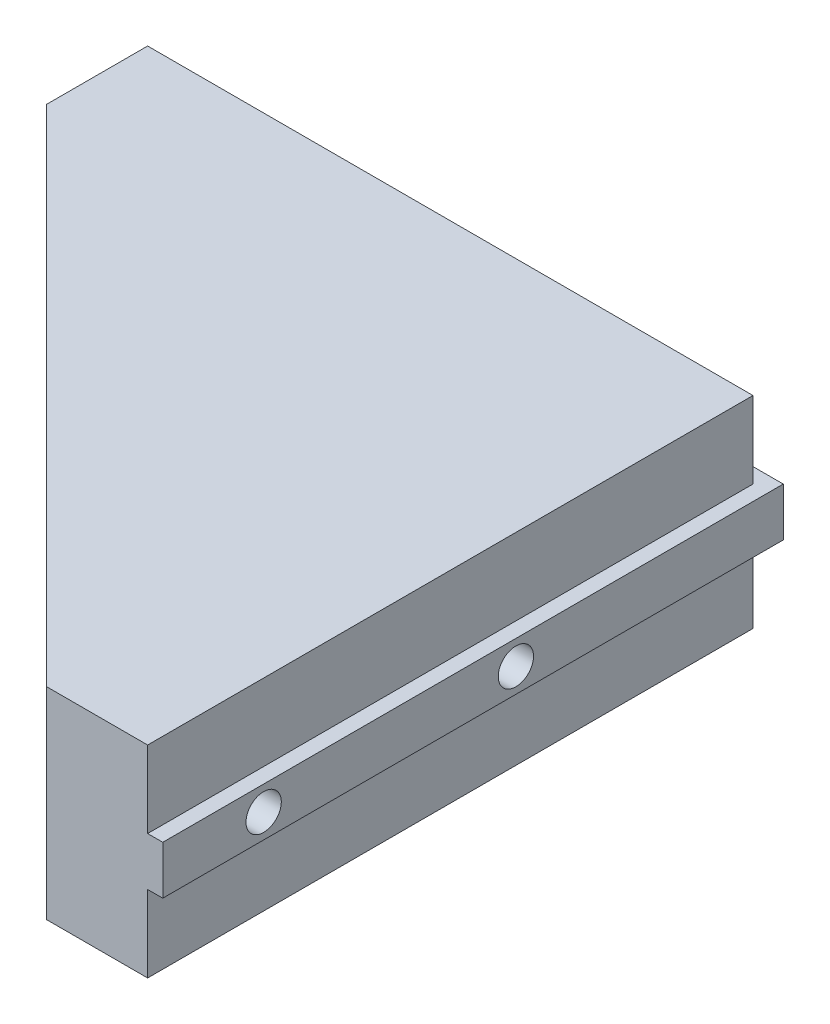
ISO-10303-21;
HEADER;
FILE_DESCRIPTION(('STEP AP214'),'2;1');
FILE_NAME('part.step','',(''),(''),'','','');
FILE_SCHEMA(('AUTOMOTIVE_DESIGN { 1 0 10303 214 1 1 1 1 }'));
ENDSEC;
DATA;
#1=APPLICATION_CONTEXT('core data for automotive mechanical design processes');
#2=APPLICATION_PROTOCOL_DEFINITION('international standard','automotive_design',2000,#1);
#3=PRODUCT_CONTEXT('',#1,'mechanical');
#4=PRODUCT('Part','Part','',(#3));
#5=PRODUCT_RELATED_PRODUCT_CATEGORY('part','',(#4));
#6=PRODUCT_DEFINITION_FORMATION('','',#4);
#7=PRODUCT_DEFINITION_CONTEXT('part definition',#1,'design');
#8=PRODUCT_DEFINITION('design','',#6,#7);
#9=PRODUCT_DEFINITION_SHAPE('','',#8);
#10=(LENGTH_UNIT() NAMED_UNIT(*) SI_UNIT(.MILLI.,.METRE.));
#11=(NAMED_UNIT(*) PLANE_ANGLE_UNIT() SI_UNIT($,.RADIAN.));
#12=(NAMED_UNIT(*) SI_UNIT($,.STERADIAN.) SOLID_ANGLE_UNIT());
#13=UNCERTAINTY_MEASURE_WITH_UNIT(LENGTH_MEASURE(1.E-05),#10,'distance_accuracy_value','');
#14=(GEOMETRIC_REPRESENTATION_CONTEXT(3) GLOBAL_UNCERTAINTY_ASSIGNED_CONTEXT((#13)) GLOBAL_UNIT_ASSIGNED_CONTEXT((#10,
#11,#12)) REPRESENTATION_CONTEXT('',''));
#15=CARTESIAN_POINT('',(0.,0.,0.));
#16=DIRECTION('',(0.,0.,1.));
#17=DIRECTION('',(1.,0.,0.));
#18=AXIS2_PLACEMENT_3D('',#15,#16,#17);
#19=CARTESIAN_POINT('',(0.,10.,0.));
#20=DIRECTION('',(-1.,0.,0.));
#21=DIRECTION('',(0.,0.,1.));
#22=AXIS2_PLACEMENT_3D('',#19,#20,#21);
#23=PLANE('',#22);
#24=DIRECTION('',(0.,0.,1.));
#25=VECTOR('',#24,1.);
#26=CARTESIAN_POINT('',(0.,-2.4,60.));
#27=LINE('',#26,#25);
#28=CARTESIAN_POINT('',(0.,-2.4,0.));
#29=VERTEX_POINT('',#28);
#30=CARTESIAN_POINT('',(0.,-2.4,60.));
#31=VERTEX_POINT('',#30);
#32=EDGE_CURVE('E63',#29,#31,#27,.T.);
#33=ORIENTED_EDGE('',*,*,#32,.T.);
#34=DIRECTION('',(0.,-1.,0.));
#35=VECTOR('',#34,1.);
#36=CARTESIAN_POINT('',(0.,10.,60.));
#37=LINE('',#36,#35);
#38=CARTESIAN_POINT('',(0.,-10.,60.));
#39=VERTEX_POINT('',#38);
#40=EDGE_CURVE('E362',#31,#39,#37,.T.);
#41=ORIENTED_EDGE('',*,*,#40,.T.);
#42=DIRECTION('',(0.,0.,-1.));
#43=VECTOR('',#42,1.);
#44=CARTESIAN_POINT('',(0.,-10.,0.));
#45=LINE('',#44,#43);
#46=CARTESIAN_POINT('',(0.,-10.,0.));
#47=VERTEX_POINT('',#46);
#48=EDGE_CURVE('E346',#39,#47,#45,.T.);
#49=ORIENTED_EDGE('',*,*,#48,.T.);
#50=DIRECTION('',(0.,-1.,0.));
#51=VECTOR('',#50,1.);
#52=CARTESIAN_POINT('',(0.,10.,0.));
#53=LINE('',#52,#51);
#54=EDGE_CURVE('E357',#29,#47,#53,.T.);
#55=ORIENTED_EDGE('',*,*,#54,.F.);
#56=EDGE_LOOP('',(#33,#41,#49,#55));
#57=FACE_BOUND('',#56,.T.);
#58=ADVANCED_FACE('F45',(#57),#23,.F.);
#59=CARTESIAN_POINT('',(-60.,10.,0.));
#60=DIRECTION('',(0.,0.,1.));
#61=DIRECTION('',(1.,0.,0.));
#62=AXIS2_PLACEMENT_3D('',#59,#60,#61);
#63=PLANE('',#62);
#64=DIRECTION('',(1.,0.,0.));
#65=VECTOR('',#64,1.);
#66=CARTESIAN_POINT('',(0.,-2.4,0.));
#67=LINE('',#66,#65);
#68=CARTESIAN_POINT('',(-60.,-2.4,0.));
#69=VERTEX_POINT('',#68);
#70=EDGE_CURVE('E269',#69,#29,#67,.T.);
#71=ORIENTED_EDGE('',*,*,#70,.T.);
#72=ORIENTED_EDGE('',*,*,#54,.T.);
#73=DIRECTION('',(-1.,0.,0.));
#74=VECTOR('',#73,1.);
#75=CARTESIAN_POINT('',(-60.,-10.,0.));
#76=LINE('',#75,#74);
#77=CARTESIAN_POINT('',(-60.,-10.,0.));
#78=VERTEX_POINT('',#77);
#79=EDGE_CURVE('E319',#47,#78,#76,.T.);
#80=ORIENTED_EDGE('',*,*,#79,.T.);
#81=DIRECTION('',(0.,-1.,0.));
#82=VECTOR('',#81,1.);
#83=CARTESIAN_POINT('',(-60.,10.,0.));
#84=LINE('',#83,#82);
#85=EDGE_CURVE('E328',#69,#78,#84,.T.);
#86=ORIENTED_EDGE('',*,*,#85,.F.);
#87=EDGE_LOOP('',(#71,#72,#80,#86));
#88=FACE_BOUND('',#87,.T.);
#89=ADVANCED_FACE('F527',(#88),#63,.F.);
#90=CARTESIAN_POINT('',(-60.,10.,10.));
#91=DIRECTION('',(1.,0.,0.));
#92=DIRECTION('',(0.,0.,-1.));
#93=AXIS2_PLACEMENT_3D('',#90,#91,#92);
#94=PLANE('',#93);
#95=DIRECTION('',(0.,0.,1.));
#96=VECTOR('',#95,1.);
#97=CARTESIAN_POINT('',(-60.,-10.,10.));
#98=LINE('',#97,#96);
#99=CARTESIAN_POINT('',(-60.,-10.,10.));
#100=VERTEX_POINT('',#99);
#101=EDGE_CURVE('E188',#78,#100,#98,.T.);
#102=ORIENTED_EDGE('',*,*,#101,.T.);
#103=DIRECTION('',(0.,-1.,0.));
#104=VECTOR('',#103,1.);
#105=CARTESIAN_POINT('',(-60.,10.,10.));
#106=LINE('',#105,#104);
#107=CARTESIAN_POINT('',(-60.,4.,10.));
#108=VERTEX_POINT('',#107);
#109=EDGE_CURVE('E55',#108,#100,#106,.T.);
#110=ORIENTED_EDGE('',*,*,#109,.F.);
#111=CARTESIAN_POINT('',(-60.,10.,10.));
#112=VERTEX_POINT('',#111);
#113=EDGE_CURVE('E11',#112,#108,#106,.T.);
#114=ORIENTED_EDGE('',*,*,#113,.F.);
#115=DIRECTION('',(0.,0.,1.));
#116=VECTOR('',#115,1.);
#117=CARTESIAN_POINT('',(-60.,10.,10.));
#118=LINE('',#117,#116);
#119=CARTESIAN_POINT('',(-60.,10.,0.));
#120=VERTEX_POINT('',#119);
#121=EDGE_CURVE('E315',#120,#112,#118,.T.);
#122=ORIENTED_EDGE('',*,*,#121,.F.);
#123=CARTESIAN_POINT('',(-60.,2.4,0.));
#124=VERTEX_POINT('',#123);
#125=EDGE_CURVE('E353',#120,#124,#84,.T.);
#126=ORIENTED_EDGE('',*,*,#125,.T.);
#127=DIRECTION('',(0.,0.,1.));
#128=VECTOR('',#127,1.);
#129=CARTESIAN_POINT('',(-60.,2.4,0.));
#130=LINE('',#129,#128);
#131=CARTESIAN_POINT('',(-60.,2.4,-1.5));
#132=VERTEX_POINT('',#131);
#133=EDGE_CURVE('E278',#132,#124,#130,.T.);
#134=ORIENTED_EDGE('',*,*,#133,.F.);
#135=DIRECTION('',(0.,-1.,0.));
#136=VECTOR('',#135,1.);
#137=CARTESIAN_POINT('',(-60.,2.4,-1.5));
#138=LINE('',#137,#136);
#139=CARTESIAN_POINT('',(-60.,-2.4,-1.5));
#140=VERTEX_POINT('',#139);
#141=EDGE_CURVE('E286',#132,#140,#138,.T.);
#142=ORIENTED_EDGE('',*,*,#141,.T.);
#143=DIRECTION('',(0.,0.,1.));
#144=VECTOR('',#143,1.);
#145=CARTESIAN_POINT('',(-60.,-2.4,0.));
#146=LINE('',#145,#144);
#147=EDGE_CURVE('E298',#140,#69,#146,.T.);
#148=ORIENTED_EDGE('',*,*,#147,.T.);
#149=ORIENTED_EDGE('',*,*,#85,.T.);
#150=EDGE_LOOP('',(#102,#110,#114,#122,#126,#134,#142,#148,#149));
#151=FACE_BOUND('',#150,.T.);
#152=ADVANCED_FACE('F47',(#151),#94,.F.);
#153=CARTESIAN_POINT('',(-60.,10.,10.));
#154=DIRECTION('',(0.,0.,-1.));
#155=DIRECTION('',(-1.,0.,0.));
#156=AXIS2_PLACEMENT_3D('',#153,#154,#155);
#157=PLANE('',#156);
#158=CARTESIAN_POINT('',(-25.,0.,10.));
#159=DIRECTION('',(0.,0.,-1.));
#160=DIRECTION('',(-1.,0.,0.));
#161=AXIS2_PLACEMENT_3D('',#158,#159,#160);
#162=CIRCLE('',#161,3.5);
#163=CARTESIAN_POINT('',(-28.5,0.,10.));
#164=VERTEX_POINT('',#163);
#165=EDGE_CURVE('E49',#164,#164,#162,.T.);
#166=ORIENTED_EDGE('',*,*,#165,.T.);
#167=EDGE_LOOP('',(#166));
#168=FACE_BOUND('',#167,.T.);
#169=CARTESIAN_POINT('',(-50.,0.,10.));
#170=DIRECTION('',(0.,0.,-1.));
#171=DIRECTION('',(-1.,0.,0.));
#172=AXIS2_PLACEMENT_3D('',#169,#170,#171);
#173=CIRCLE('',#172,3.5);
#174=CARTESIAN_POINT('',(-53.5,0.,10.));
#175=VERTEX_POINT('',#174);
#176=EDGE_CURVE('E223',#175,#175,#173,.T.);
#177=ORIENTED_EDGE('',*,*,#176,.T.);
#178=EDGE_LOOP('',(#177));
#179=FACE_BOUND('',#178,.T.);
#180=DIRECTION('',(0.,-1.,0.));
#181=VECTOR('',#180,1.);
#182=CARTESIAN_POINT('',(-20.,10.,10.));
#183=LINE('',#182,#181);
#184=CARTESIAN_POINT('',(-20.,4.,10.));
#185=VERTEX_POINT('',#184);
#186=CARTESIAN_POINT('',(-20.,-10.,10.));
#187=VERTEX_POINT('',#186);
#188=EDGE_CURVE('E183',#185,#187,#183,.T.);
#189=ORIENTED_EDGE('',*,*,#188,.F.);
#190=DIRECTION('',(-1.,0.,0.));
#191=VECTOR('',#190,1.);
#192=CARTESIAN_POINT('',(-20.,4.,10.));
#193=LINE('',#192,#191);
#194=EDGE_CURVE('E172',#185,#108,#193,.T.);
#195=ORIENTED_EDGE('',*,*,#194,.T.);
#196=ORIENTED_EDGE('',*,*,#109,.T.);
#197=DIRECTION('',(1.,0.,0.));
#198=VECTOR('',#197,1.);
#199=CARTESIAN_POINT('',(-60.,-10.,10.));
#200=LINE('',#199,#198);
#201=EDGE_CURVE('E331',#100,#187,#200,.T.);
#202=ORIENTED_EDGE('',*,*,#201,.T.);
#203=EDGE_LOOP('',(#189,#195,#196,#202));
#204=FACE_BOUND('',#203,.T.);
#205=ADVANCED_FACE('F180',(#168,#179,#204),#157,.F.);
#206=CARTESIAN_POINT('',(-20.,10.,10.));
#207=DIRECTION('',(0.707106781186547,0.,-0.707106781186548));
#208=DIRECTION('',(-0.707106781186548,0.,-0.707106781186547));
#209=AXIS2_PLACEMENT_3D('',#206,#207,#208);
#210=PLANE('',#209);
#211=DIRECTION('',(0.,-1.,0.));
#212=VECTOR('',#211,1.);
#213=CARTESIAN_POINT('',(-9.99999999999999,10.,20.));
#214=LINE('',#213,#212);
#215=CARTESIAN_POINT('',(-9.99999999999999,4.,20.));
#216=VERTEX_POINT('',#215);
#217=CARTESIAN_POINT('',(-9.99999999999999,-10.,20.));
#218=VERTEX_POINT('',#217);
#219=EDGE_CURVE('E193',#216,#218,#214,.T.);
#220=ORIENTED_EDGE('',*,*,#219,.F.);
#221=DIRECTION('',(-0.707106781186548,0.,-0.707106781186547));
#222=VECTOR('',#221,1.);
#223=CARTESIAN_POINT('',(-9.99999999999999,4.,20.));
#224=LINE('',#223,#222);
#225=EDGE_CURVE('E470',#216,#185,#224,.T.);
#226=ORIENTED_EDGE('',*,*,#225,.T.);
#227=ORIENTED_EDGE('',*,*,#188,.T.);
#228=DIRECTION('',(0.707106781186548,0.,0.707106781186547));
#229=VECTOR('',#228,1.);
#230=CARTESIAN_POINT('',(-20.,-10.,10.));
#231=LINE('',#230,#229);
#232=EDGE_CURVE('E334',#187,#218,#231,.T.);
#233=ORIENTED_EDGE('',*,*,#232,.T.);
#234=EDGE_LOOP('',(#220,#226,#227,#233));
#235=FACE_BOUND('',#234,.T.);
#236=ADVANCED_FACE('F378',(#235),#210,.F.);
#237=CARTESIAN_POINT('',(-9.99999999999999,10.,20.));
#238=DIRECTION('',(1.,0.,0.));
#239=DIRECTION('',(0.,0.,-1.));
#240=AXIS2_PLACEMENT_3D('',#237,#238,#239);
#241=PLANE('',#240);
#242=CARTESIAN_POINT('',(-9.99999999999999,0.,50.));
#243=DIRECTION('',(1.,0.,0.));
#244=DIRECTION('',(0.,0.,-1.));
#245=AXIS2_PLACEMENT_3D('',#242,#243,#244);
#246=CIRCLE('',#245,3.5);
#247=CARTESIAN_POINT('',(-9.99999999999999,0.,46.5));
#248=VERTEX_POINT('',#247);
#249=EDGE_CURVE('E210',#248,#248,#246,.T.);
#250=ORIENTED_EDGE('',*,*,#249,.T.);
#251=EDGE_LOOP('',(#250));
#252=FACE_BOUND('',#251,.T.);
#253=CARTESIAN_POINT('',(-9.99999999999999,0.,25.));
#254=DIRECTION('',(1.,0.,0.));
#255=DIRECTION('',(0.,0.,-1.));
#256=AXIS2_PLACEMENT_3D('',#253,#254,#255);
#257=CIRCLE('',#256,3.5);
#258=CARTESIAN_POINT('',(-9.99999999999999,0.,21.5));
#259=VERTEX_POINT('',#258);
#260=EDGE_CURVE('E206',#259,#259,#257,.T.);
#261=ORIENTED_EDGE('',*,*,#260,.T.);
#262=EDGE_LOOP('',(#261));
#263=FACE_BOUND('',#262,.T.);
#264=DIRECTION('',(0.,-1.,0.));
#265=VECTOR('',#264,1.);
#266=CARTESIAN_POINT('',(-9.99999999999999,10.,60.));
#267=LINE('',#266,#265);
#268=CARTESIAN_POINT('',(-9.99999999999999,4.,60.));
#269=VERTEX_POINT('',#268);
#270=CARTESIAN_POINT('',(-9.99999999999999,-10.,60.));
#271=VERTEX_POINT('',#270);
#272=EDGE_CURVE('E365',#269,#271,#267,.T.);
#273=ORIENTED_EDGE('',*,*,#272,.F.);
#274=DIRECTION('',(0.,0.,-1.));
#275=VECTOR('',#274,1.);
#276=CARTESIAN_POINT('',(-9.99999999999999,4.,60.));
#277=LINE('',#276,#275);
#278=EDGE_CURVE('E175',#269,#216,#277,.T.);
#279=ORIENTED_EDGE('',*,*,#278,.T.);
#280=ORIENTED_EDGE('',*,*,#219,.T.);
#281=DIRECTION('',(0.,0.,1.));
#282=VECTOR('',#281,1.);
#283=CARTESIAN_POINT('',(-9.99999999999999,-10.,20.));
#284=LINE('',#283,#282);
#285=EDGE_CURVE('E338',#218,#271,#284,.T.);
#286=ORIENTED_EDGE('',*,*,#285,.T.);
#287=EDGE_LOOP('',(#273,#279,#280,#286));
#288=FACE_BOUND('',#287,.T.);
#289=ADVANCED_FACE('F373',(#252,#263,#288),#241,.F.);
#290=CARTESIAN_POINT('',(0.,10.,60.));
#291=DIRECTION('',(0.,0.,-1.));
#292=DIRECTION('',(-1.,0.,0.));
#293=AXIS2_PLACEMENT_3D('',#290,#291,#292);
#294=PLANE('',#293);
#295=DIRECTION('',(1.,0.,0.));
#296=VECTOR('',#295,1.);
#297=CARTESIAN_POINT('',(0.,-10.,60.));
#298=LINE('',#297,#296);
#299=EDGE_CURVE('E342',#271,#39,#298,.T.);
#300=ORIENTED_EDGE('',*,*,#299,.T.);
#301=ORIENTED_EDGE('',*,*,#40,.F.);
#302=DIRECTION('',(1.,0.,0.));
#303=VECTOR('',#302,1.);
#304=CARTESIAN_POINT('',(1.50000000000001,-2.4,60.));
#305=LINE('',#304,#303);
#306=CARTESIAN_POINT('',(1.50000000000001,-2.4,60.));
#307=VERTEX_POINT('',#306);
#308=EDGE_CURVE('E289',#31,#307,#305,.T.);
#309=ORIENTED_EDGE('',*,*,#308,.T.);
#310=DIRECTION('',(0.,-1.,0.));
#311=VECTOR('',#310,1.);
#312=CARTESIAN_POINT('',(1.50000000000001,2.4,60.));
#313=LINE('',#312,#311);
#314=CARTESIAN_POINT('',(1.50000000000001,2.4,60.));
#315=VERTEX_POINT('',#314);
#316=EDGE_CURVE('E311',#315,#307,#313,.T.);
#317=ORIENTED_EDGE('',*,*,#316,.F.);
#318=DIRECTION('',(1.,0.,0.));
#319=VECTOR('',#318,1.);
#320=CARTESIAN_POINT('',(1.50000000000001,2.4,60.));
#321=LINE('',#320,#319);
#322=CARTESIAN_POINT('',(0.,2.4,60.));
#323=VERTEX_POINT('',#322);
#324=EDGE_CURVE('E268',#323,#315,#321,.T.);
#325=ORIENTED_EDGE('',*,*,#324,.F.);
#326=CARTESIAN_POINT('',(0.,10.,60.));
#327=VERTEX_POINT('',#326);
#328=EDGE_CURVE('E71',#327,#323,#37,.T.);
#329=ORIENTED_EDGE('',*,*,#328,.F.);
#330=DIRECTION('',(1.,0.,0.));
#331=VECTOR('',#330,1.);
#332=CARTESIAN_POINT('',(0.,10.,60.));
#333=LINE('',#332,#331);
#334=CARTESIAN_POINT('',(-9.99999999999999,10.,60.));
#335=VERTEX_POINT('',#334);
#336=EDGE_CURVE('E318',#335,#327,#333,.T.);
#337=ORIENTED_EDGE('',*,*,#336,.F.);
#338=EDGE_CURVE('E366',#335,#269,#267,.T.);
#339=ORIENTED_EDGE('',*,*,#338,.T.);
#340=ORIENTED_EDGE('',*,*,#272,.T.);
#341=EDGE_LOOP('',(#300,#301,#309,#317,#325,#329,#337,#339,#340));
#342=FACE_BOUND('',#341,.T.);
#343=ADVANCED_FACE('F384',(#342),#294,.F.);
#344=ORIENTED_EDGE('',*,*,#328,.T.);
#345=DIRECTION('',(0.,0.,1.));
#346=VECTOR('',#345,1.);
#347=CARTESIAN_POINT('',(0.,2.4,60.));
#348=LINE('',#347,#346);
#349=CARTESIAN_POINT('',(0.,2.4,0.));
#350=VERTEX_POINT('',#349);
#351=EDGE_CURVE('E264',#350,#323,#348,.T.);
#352=ORIENTED_EDGE('',*,*,#351,.F.);
#353=CARTESIAN_POINT('',(0.,10.,0.));
#354=VERTEX_POINT('',#353);
#355=EDGE_CURVE('E358',#354,#350,#53,.T.);
#356=ORIENTED_EDGE('',*,*,#355,.F.);
#357=DIRECTION('',(0.,0.,-1.));
#358=VECTOR('',#357,1.);
#359=CARTESIAN_POINT('',(0.,10.,0.));
#360=LINE('',#359,#358);
#361=EDGE_CURVE('E322',#327,#354,#360,.T.);
#362=ORIENTED_EDGE('',*,*,#361,.F.);
#363=EDGE_LOOP('',(#344,#352,#356,#362));
#364=FACE_BOUND('',#363,.T.);
#365=ADVANCED_FACE('F530',(#364),#23,.F.);
#366=ORIENTED_EDGE('',*,*,#355,.T.);
#367=DIRECTION('',(1.,0.,0.));
#368=VECTOR('',#367,1.);
#369=CARTESIAN_POINT('',(0.,2.4,0.));
#370=LINE('',#369,#368);
#371=EDGE_CURVE('E282',#124,#350,#370,.T.);
#372=ORIENTED_EDGE('',*,*,#371,.F.);
#373=ORIENTED_EDGE('',*,*,#125,.F.);
#374=DIRECTION('',(-1.,0.,0.));
#375=VECTOR('',#374,1.);
#376=CARTESIAN_POINT('',(-60.,10.,0.));
#377=LINE('',#376,#375);
#378=EDGE_CURVE('E325',#354,#120,#377,.T.);
#379=ORIENTED_EDGE('',*,*,#378,.F.);
#380=EDGE_LOOP('',(#366,#372,#373,#379));
#381=FACE_BOUND('',#380,.T.);
#382=ADVANCED_FACE('F535',(#381),#63,.F.);
#383=CARTESIAN_POINT('',(0.,10.,0.));
#384=DIRECTION('',(0.,-1.,0.));
#385=DIRECTION('',(0.,0.,-1.));
#386=AXIS2_PLACEMENT_3D('',#383,#384,#385);
#387=PLANE('',#386);
#388=ORIENTED_EDGE('',*,*,#121,.T.);
#389=DIRECTION('',(0.707106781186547,0.,0.707106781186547));
#390=VECTOR('',#389,1.);
#391=CARTESIAN_POINT('',(-60.,10.,10.));
#392=LINE('',#391,#390);
#393=EDGE_CURVE('E164',#112,#335,#392,.T.);
#394=ORIENTED_EDGE('',*,*,#393,.T.);
#395=ORIENTED_EDGE('',*,*,#336,.T.);
#396=ORIENTED_EDGE('',*,*,#361,.T.);
#397=ORIENTED_EDGE('',*,*,#378,.T.);
#398=EDGE_LOOP('',(#388,#394,#395,#396,#397));
#399=FACE_BOUND('',#398,.T.);
#400=ADVANCED_FACE('F542',(#399),#387,.F.);
#401=CARTESIAN_POINT('',(0.,-10.,0.));
#402=DIRECTION('',(0.,-1.,0.));
#403=DIRECTION('',(0.,0.,-1.));
#404=AXIS2_PLACEMENT_3D('',#401,#402,#403);
#405=PLANE('',#404);
#406=ORIENTED_EDGE('',*,*,#101,.F.);
#407=ORIENTED_EDGE('',*,*,#79,.F.);
#408=ORIENTED_EDGE('',*,*,#48,.F.);
#409=ORIENTED_EDGE('',*,*,#299,.F.);
#410=ORIENTED_EDGE('',*,*,#285,.F.);
#411=ORIENTED_EDGE('',*,*,#232,.F.);
#412=ORIENTED_EDGE('',*,*,#201,.F.);
#413=EDGE_LOOP('',(#406,#407,#408,#409,#410,#411,#412));
#414=FACE_BOUND('',#413,.T.);
#415=ADVANCED_FACE('F380',(#414),#405,.T.);
#416=CARTESIAN_POINT('',(1.5,2.4,-1.5));
#417=DIRECTION('',(-1.,0.,0.));
#418=DIRECTION('',(0.,0.,1.));
#419=AXIS2_PLACEMENT_3D('',#416,#417,#418);
#420=PLANE('',#419);
#421=CARTESIAN_POINT('',(1.50000000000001,0.,50.));
#422=DIRECTION('',(1.,0.,0.));
#423=DIRECTION('',(0.,0.,-1.));
#424=AXIS2_PLACEMENT_3D('',#421,#422,#423);
#425=CIRCLE('',#424,1.75);
#426=CARTESIAN_POINT('',(1.50000000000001,0.,48.25));
#427=VERTEX_POINT('',#426);
#428=EDGE_CURVE('E256',#427,#427,#425,.T.);
#429=ORIENTED_EDGE('',*,*,#428,.F.);
#430=EDGE_LOOP('',(#429));
#431=FACE_BOUND('',#430,.T.);
#432=CARTESIAN_POINT('',(1.5,0.,25.));
#433=DIRECTION('',(1.,0.,0.));
#434=DIRECTION('',(0.,0.,-1.));
#435=AXIS2_PLACEMENT_3D('',#432,#433,#434);
#436=CIRCLE('',#435,1.75);
#437=CARTESIAN_POINT('',(1.5,0.,23.25));
#438=VERTEX_POINT('',#437);
#439=EDGE_CURVE('E260',#438,#438,#436,.T.);
#440=ORIENTED_EDGE('',*,*,#439,.F.);
#441=EDGE_LOOP('',(#440));
#442=FACE_BOUND('',#441,.T.);
#443=DIRECTION('',(0.,0.,-1.));
#444=VECTOR('',#443,1.);
#445=CARTESIAN_POINT('',(1.5,-2.4,-1.5));
#446=LINE('',#445,#444);
#447=CARTESIAN_POINT('',(1.5,-2.4,-1.5));
#448=VERTEX_POINT('',#447);
#449=EDGE_CURVE('E292',#307,#448,#446,.T.);
#450=ORIENTED_EDGE('',*,*,#449,.T.);
#451=DIRECTION('',(0.,-1.,0.));
#452=VECTOR('',#451,1.);
#453=CARTESIAN_POINT('',(1.5,2.4,-1.5));
#454=LINE('',#453,#452);
#455=CARTESIAN_POINT('',(1.5,2.4,-1.5));
#456=VERTEX_POINT('',#455);
#457=EDGE_CURVE('E307',#456,#448,#454,.T.);
#458=ORIENTED_EDGE('',*,*,#457,.F.);
#459=DIRECTION('',(0.,0.,-1.));
#460=VECTOR('',#459,1.);
#461=CARTESIAN_POINT('',(1.5,2.4,-1.5));
#462=LINE('',#461,#460);
#463=EDGE_CURVE('E272',#315,#456,#462,.T.);
#464=ORIENTED_EDGE('',*,*,#463,.F.);
#465=ORIENTED_EDGE('',*,*,#316,.T.);
#466=EDGE_LOOP('',(#450,#458,#464,#465));
#467=FACE_BOUND('',#466,.T.);
#468=ADVANCED_FACE('F513',(#431,#442,#467),#420,.F.);
#469=CARTESIAN_POINT('',(-60.,2.4,-1.5));
#470=DIRECTION('',(0.,0.,1.));
#471=DIRECTION('',(1.,0.,0.));
#472=AXIS2_PLACEMENT_3D('',#469,#470,#471);
#473=PLANE('',#472);
#474=CARTESIAN_POINT('',(-50.,0.,-1.5));
#475=DIRECTION('',(0.,0.,-1.));
#476=DIRECTION('',(-1.,0.,0.));
#477=AXIS2_PLACEMENT_3D('',#474,#475,#476);
#478=CIRCLE('',#477,1.74999999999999);
#479=CARTESIAN_POINT('',(-51.75,0.,-1.5));
#480=VERTEX_POINT('',#479);
#481=EDGE_CURVE('E214',#480,#480,#478,.T.);
#482=ORIENTED_EDGE('',*,*,#481,.F.);
#483=EDGE_LOOP('',(#482));
#484=FACE_BOUND('',#483,.T.);
#485=CARTESIAN_POINT('',(-25.,0.,-1.5));
#486=DIRECTION('',(0.,0.,-1.));
#487=DIRECTION('',(-1.,0.,0.));
#488=AXIS2_PLACEMENT_3D('',#485,#486,#487);
#489=CIRCLE('',#488,1.74999999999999);
#490=CARTESIAN_POINT('',(-26.75,0.,-1.5));
#491=VERTEX_POINT('',#490);
#492=EDGE_CURVE('E252',#491,#491,#489,.T.);
#493=ORIENTED_EDGE('',*,*,#492,.F.);
#494=EDGE_LOOP('',(#493));
#495=FACE_BOUND('',#494,.T.);
#496=DIRECTION('',(-1.,0.,0.));
#497=VECTOR('',#496,1.);
#498=CARTESIAN_POINT('',(-60.,-2.4,-1.5));
#499=LINE('',#498,#497);
#500=EDGE_CURVE('E295',#448,#140,#499,.T.);
#501=ORIENTED_EDGE('',*,*,#500,.T.);
#502=ORIENTED_EDGE('',*,*,#141,.F.);
#503=DIRECTION('',(-1.,0.,0.));
#504=VECTOR('',#503,1.);
#505=CARTESIAN_POINT('',(-60.,2.4,-1.5));
#506=LINE('',#505,#504);
#507=EDGE_CURVE('E275',#456,#132,#506,.T.);
#508=ORIENTED_EDGE('',*,*,#507,.F.);
#509=ORIENTED_EDGE('',*,*,#457,.T.);
#510=EDGE_LOOP('',(#501,#502,#508,#509));
#511=FACE_BOUND('',#510,.T.);
#512=ADVANCED_FACE('F509',(#484,#495,#511),#473,.F.);
#513=CARTESIAN_POINT('',(0.,2.4,0.));
#514=DIRECTION('',(0.,1.,0.));
#515=DIRECTION('',(0.,0.,1.));
#516=AXIS2_PLACEMENT_3D('',#513,#514,#515);
#517=PLANE('',#516);
#518=ORIENTED_EDGE('',*,*,#351,.T.);
#519=ORIENTED_EDGE('',*,*,#324,.T.);
#520=ORIENTED_EDGE('',*,*,#463,.T.);
#521=ORIENTED_EDGE('',*,*,#507,.T.);
#522=ORIENTED_EDGE('',*,*,#133,.T.);
#523=ORIENTED_EDGE('',*,*,#371,.T.);
#524=EDGE_LOOP('',(#518,#519,#520,#521,#522,#523));
#525=FACE_BOUND('',#524,.T.);
#526=ADVANCED_FACE('F512',(#525),#517,.T.);
#527=CARTESIAN_POINT('',(0.,-2.4,0.));
#528=DIRECTION('',(0.,1.,0.));
#529=DIRECTION('',(0.,0.,1.));
#530=AXIS2_PLACEMENT_3D('',#527,#528,#529);
#531=PLANE('',#530);
#532=ORIENTED_EDGE('',*,*,#32,.F.);
#533=ORIENTED_EDGE('',*,*,#70,.F.);
#534=ORIENTED_EDGE('',*,*,#147,.F.);
#535=ORIENTED_EDGE('',*,*,#500,.F.);
#536=ORIENTED_EDGE('',*,*,#449,.F.);
#537=ORIENTED_EDGE('',*,*,#308,.F.);
#538=EDGE_LOOP('',(#532,#533,#534,#535,#536,#537));
#539=FACE_BOUND('',#538,.T.);
#540=ADVANCED_FACE('F525',(#539),#531,.F.);
#541=CARTESIAN_POINT('',(1.5,0.,25.));
#542=DIRECTION('',(1.,0.,0.));
#543=DIRECTION('',(0.,0.,-1.));
#544=AXIS2_PLACEMENT_3D('',#541,#542,#543);
#545=CYLINDRICAL_SURFACE('',#544,1.74999999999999);
#546=CARTESIAN_POINT('',(-6.5,0.,25.));
#547=DIRECTION('',(1.,0.,0.));
#548=DIRECTION('',(0.,0.,-1.));
#549=AXIS2_PLACEMENT_3D('',#546,#547,#548);
#550=CIRCLE('',#549,1.74999999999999);
#551=CARTESIAN_POINT('',(-6.5,0.,23.25));
#552=VERTEX_POINT('',#551);
#553=EDGE_CURVE('E201',#552,#552,#550,.F.);
#554=ORIENTED_EDGE('',*,*,#553,.T.);
#555=EDGE_LOOP('',(#554));
#556=FACE_BOUND('',#555,.T.);
#557=ORIENTED_EDGE('',*,*,#439,.T.);
#558=EDGE_LOOP('',(#557));
#559=FACE_BOUND('',#558,.T.);
#560=ADVANCED_FACE('F625',(#556,#559),#545,.F.);
#561=CARTESIAN_POINT('',(1.50000000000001,0.,50.));
#562=DIRECTION('',(1.,0.,0.));
#563=DIRECTION('',(0.,0.,-1.));
#564=AXIS2_PLACEMENT_3D('',#561,#562,#563);
#565=CYLINDRICAL_SURFACE('',#564,1.74999999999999);
#566=CARTESIAN_POINT('',(-6.49999999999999,0.,50.));
#567=DIRECTION('',(1.,0.,0.));
#568=DIRECTION('',(0.,0.,-1.));
#569=AXIS2_PLACEMENT_3D('',#566,#567,#568);
#570=CIRCLE('',#569,1.74999999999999);
#571=CARTESIAN_POINT('',(-6.49999999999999,0.,48.25));
#572=VERTEX_POINT('',#571);
#573=EDGE_CURVE('E197',#572,#572,#570,.F.);
#574=ORIENTED_EDGE('',*,*,#573,.T.);
#575=EDGE_LOOP('',(#574));
#576=FACE_BOUND('',#575,.T.);
#577=ORIENTED_EDGE('',*,*,#428,.T.);
#578=EDGE_LOOP('',(#577));
#579=FACE_BOUND('',#578,.T.);
#580=ADVANCED_FACE('F505',(#576,#579),#565,.F.);
#581=CARTESIAN_POINT('',(-25.,0.,-1.5));
#582=DIRECTION('',(0.,0.,-1.));
#583=DIRECTION('',(-1.,0.,0.));
#584=AXIS2_PLACEMENT_3D('',#581,#582,#583);
#585=CYLINDRICAL_SURFACE('',#584,1.74999999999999);
#586=CARTESIAN_POINT('',(-25.,0.,6.5));
#587=DIRECTION('',(0.,0.,-1.));
#588=DIRECTION('',(-1.,0.,0.));
#589=AXIS2_PLACEMENT_3D('',#586,#587,#588);
#590=CIRCLE('',#589,1.74999999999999);
#591=CARTESIAN_POINT('',(-26.75,0.,6.5));
#592=VERTEX_POINT('',#591);
#593=EDGE_CURVE('E219',#592,#592,#590,.F.);
#594=ORIENTED_EDGE('',*,*,#593,.T.);
#595=EDGE_LOOP('',(#594));
#596=FACE_BOUND('',#595,.T.);
#597=ORIENTED_EDGE('',*,*,#492,.T.);
#598=EDGE_LOOP('',(#597));
#599=FACE_BOUND('',#598,.T.);
#600=ADVANCED_FACE('F501',(#596,#599),#585,.F.);
#601=CARTESIAN_POINT('',(-50.,0.,-1.5));
#602=DIRECTION('',(0.,0.,-1.));
#603=DIRECTION('',(-1.,0.,0.));
#604=AXIS2_PLACEMENT_3D('',#601,#602,#603);
#605=CYLINDRICAL_SURFACE('',#604,1.74999999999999);
#606=CARTESIAN_POINT('',(-50.,0.,6.5));
#607=DIRECTION('',(0.,0.,-1.));
#608=DIRECTION('',(-1.,0.,0.));
#609=AXIS2_PLACEMENT_3D('',#606,#607,#608);
#610=CIRCLE('',#609,1.74999999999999);
#611=CARTESIAN_POINT('',(-51.75,0.,6.5));
#612=VERTEX_POINT('',#611);
#613=EDGE_CURVE('E215',#612,#612,#610,.F.);
#614=ORIENTED_EDGE('',*,*,#613,.T.);
#615=EDGE_LOOP('',(#614));
#616=FACE_BOUND('',#615,.T.);
#617=ORIENTED_EDGE('',*,*,#481,.T.);
#618=EDGE_LOOP('',(#617));
#619=FACE_BOUND('',#618,.T.);
#620=ADVANCED_FACE('F504',(#616,#619),#605,.F.);
#621=CARTESIAN_POINT('',(-60.,0.,50.));
#622=DIRECTION('',(1.,0.,0.));
#623=DIRECTION('',(0.,0.,-1.));
#624=AXIS2_PLACEMENT_3D('',#621,#622,#623);
#625=CYLINDRICAL_SURFACE('',#624,3.5);
#626=CARTESIAN_POINT('',(-6.49999999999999,0.,50.));
#627=DIRECTION('',(1.,0.,0.));
#628=DIRECTION('',(0.,0.,-1.));
#629=AXIS2_PLACEMENT_3D('',#626,#627,#628);
#630=CIRCLE('',#629,3.5);
#631=CARTESIAN_POINT('',(-6.49999999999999,0.,46.5));
#632=VERTEX_POINT('',#631);
#633=EDGE_CURVE('E202',#632,#632,#630,.T.);
#634=ORIENTED_EDGE('',*,*,#633,.T.);
#635=EDGE_LOOP('',(#634));
#636=FACE_BOUND('',#635,.T.);
#637=ORIENTED_EDGE('',*,*,#249,.F.);
#638=EDGE_LOOP('',(#637));
#639=FACE_BOUND('',#638,.T.);
#640=ADVANCED_FACE('F691',(#636,#639),#625,.F.);
#641=CARTESIAN_POINT('',(-6.49999999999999,0.,50.));
#642=DIRECTION('',(1.,0.,0.));
#643=DIRECTION('',(0.,0.,-1.));
#644=AXIS2_PLACEMENT_3D('',#641,#642,#643);
#645=PLANE('',#644);
#646=ORIENTED_EDGE('',*,*,#633,.F.);
#647=EDGE_LOOP('',(#646));
#648=FACE_BOUND('',#647,.T.);
#649=ORIENTED_EDGE('',*,*,#573,.F.);
#650=EDGE_LOOP('',(#649));
#651=FACE_BOUND('',#650,.T.);
#652=ADVANCED_FACE('F684',(#648,#651),#645,.F.);
#653=CARTESIAN_POINT('',(-60.,0.,25.));
#654=DIRECTION('',(1.,0.,0.));
#655=DIRECTION('',(0.,0.,-1.));
#656=AXIS2_PLACEMENT_3D('',#653,#654,#655);
#657=CYLINDRICAL_SURFACE('',#656,3.5);
#658=CARTESIAN_POINT('',(-6.5,0.,25.));
#659=DIRECTION('',(1.,0.,0.));
#660=DIRECTION('',(0.,0.,-1.));
#661=AXIS2_PLACEMENT_3D('',#658,#659,#660);
#662=CIRCLE('',#661,3.5);
#663=CARTESIAN_POINT('',(-6.5,0.,21.5));
#664=VERTEX_POINT('',#663);
#665=EDGE_CURVE('E232',#664,#664,#662,.T.);
#666=ORIENTED_EDGE('',*,*,#665,.T.);
#667=EDGE_LOOP('',(#666));
#668=FACE_BOUND('',#667,.T.);
#669=ORIENTED_EDGE('',*,*,#260,.F.);
#670=EDGE_LOOP('',(#669));
#671=FACE_BOUND('',#670,.T.);
#672=ADVANCED_FACE('F676',(#668,#671),#657,.F.);
#673=CARTESIAN_POINT('',(-6.5,0.,25.));
#674=DIRECTION('',(1.,0.,0.));
#675=DIRECTION('',(0.,0.,-1.));
#676=AXIS2_PLACEMENT_3D('',#673,#674,#675);
#677=PLANE('',#676);
#678=ORIENTED_EDGE('',*,*,#665,.F.);
#679=EDGE_LOOP('',(#678));
#680=FACE_BOUND('',#679,.T.);
#681=ORIENTED_EDGE('',*,*,#553,.F.);
#682=EDGE_LOOP('',(#681));
#683=FACE_BOUND('',#682,.T.);
#684=ADVANCED_FACE('F578',(#680,#683),#677,.F.);
#685=CARTESIAN_POINT('',(-50.,0.,60.));
#686=DIRECTION('',(0.,0.,-1.));
#687=DIRECTION('',(-1.,0.,0.));
#688=AXIS2_PLACEMENT_3D('',#685,#686,#687);
#689=CYLINDRICAL_SURFACE('',#688,3.5);
#690=CARTESIAN_POINT('',(-50.,0.,6.5));
#691=DIRECTION('',(0.,0.,-1.));
#692=DIRECTION('',(-1.,0.,0.));
#693=AXIS2_PLACEMENT_3D('',#690,#691,#692);
#694=CIRCLE('',#693,3.5);
#695=CARTESIAN_POINT('',(-53.5,0.,6.50000000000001));
#696=VERTEX_POINT('',#695);
#697=EDGE_CURVE('E483',#696,#696,#694,.T.);
#698=CARTESIAN_POINT('',(-53.5,0.,6.50000000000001));
#699=CARTESIAN_POINT('',(-53.5,0.,6.53645833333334));
#700=CARTESIAN_POINT('',(-53.5,0.,6.57291666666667));
#701=CARTESIAN_POINT('',(-53.5,0.,6.64583333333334));
#702=CARTESIAN_POINT('',(-53.5,0.,6.68229166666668));
#703=CARTESIAN_POINT('',(-53.5,0.,6.75520833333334));
#704=CARTESIAN_POINT('',(-53.5,0.,6.79166666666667));
#705=CARTESIAN_POINT('',(-53.5,0.,6.86458333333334));
#706=CARTESIAN_POINT('',(-53.5,0.,6.90104166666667));
#707=CARTESIAN_POINT('',(-53.5,0.,6.97395833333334));
#708=CARTESIAN_POINT('',(-53.5,0.,7.01041666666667));
#709=CARTESIAN_POINT('',(-53.5,0.,7.08333333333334));
#710=CARTESIAN_POINT('',(-53.5,0.,7.11979166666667));
#711=CARTESIAN_POINT('',(-53.5,0.,7.19270833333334));
#712=CARTESIAN_POINT('',(-53.5,0.,7.22916666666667));
#713=CARTESIAN_POINT('',(-53.5,0.,7.30208333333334));
#714=CARTESIAN_POINT('',(-53.5,0.,7.33854166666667));
#715=CARTESIAN_POINT('',(-53.5,0.,7.41145833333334));
#716=CARTESIAN_POINT('',(-53.5,0.,7.44791666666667));
#717=CARTESIAN_POINT('',(-53.5,0.,7.52083333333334));
#718=CARTESIAN_POINT('',(-53.5,0.,7.55729166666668));
#719=CARTESIAN_POINT('',(-53.5,0.,7.63020833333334));
#720=CARTESIAN_POINT('',(-53.5,0.,7.66666666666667));
#721=CARTESIAN_POINT('',(-53.5,0.,7.73958333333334));
#722=CARTESIAN_POINT('',(-53.5,0.,7.77604166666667));
#723=CARTESIAN_POINT('',(-53.5,0.,7.84895833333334));
#724=CARTESIAN_POINT('',(-53.5,0.,7.88541666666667));
#725=CARTESIAN_POINT('',(-53.5,0.,7.95833333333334));
#726=CARTESIAN_POINT('',(-53.5,0.,7.99479166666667));
#727=CARTESIAN_POINT('',(-53.5,0.,8.06770833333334));
#728=CARTESIAN_POINT('',(-53.5,0.,8.10416666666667));
#729=CARTESIAN_POINT('',(-53.5,0.,8.17708333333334));
#730=CARTESIAN_POINT('',(-53.5,0.,8.21354166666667));
#731=CARTESIAN_POINT('',(-53.5,0.,8.28645833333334));
#732=CARTESIAN_POINT('',(-53.5,0.,8.32291666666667));
#733=CARTESIAN_POINT('',(-53.5,0.,8.39583333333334));
#734=CARTESIAN_POINT('',(-53.5,0.,8.43229166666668));
#735=CARTESIAN_POINT('',(-53.5,0.,8.50520833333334));
#736=CARTESIAN_POINT('',(-53.5,0.,8.54166666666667));
#737=CARTESIAN_POINT('',(-53.5,0.,8.61458333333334));
#738=CARTESIAN_POINT('',(-53.5,0.,8.65104166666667));
#739=CARTESIAN_POINT('',(-53.5,0.,8.72395833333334));
#740=CARTESIAN_POINT('',(-53.5,0.,8.76041666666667));
#741=CARTESIAN_POINT('',(-53.5,0.,8.83333333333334));
#742=CARTESIAN_POINT('',(-53.5,0.,8.86979166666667));
#743=CARTESIAN_POINT('',(-53.5,0.,8.94270833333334));
#744=CARTESIAN_POINT('',(-53.5,0.,8.97916666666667));
#745=CARTESIAN_POINT('',(-53.5,0.,9.05208333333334));
#746=CARTESIAN_POINT('',(-53.5,0.,9.08854166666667));
#747=CARTESIAN_POINT('',(-53.5,0.,9.16145833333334));
#748=CARTESIAN_POINT('',(-53.5,0.,9.19791666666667));
#749=CARTESIAN_POINT('',(-53.5,0.,9.27083333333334));
#750=CARTESIAN_POINT('',(-53.5,0.,9.30729166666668));
#751=CARTESIAN_POINT('',(-53.5,0.,9.38020833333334));
#752=CARTESIAN_POINT('',(-53.5,0.,9.41666666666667));
#753=CARTESIAN_POINT('',(-53.5,0.,9.48958333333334));
#754=CARTESIAN_POINT('',(-53.5,0.,9.52604166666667));
#755=CARTESIAN_POINT('',(-53.5,0.,9.59895833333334));
#756=CARTESIAN_POINT('',(-53.5,0.,9.63541666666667));
#757=CARTESIAN_POINT('',(-53.5,0.,9.70833333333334));
#758=CARTESIAN_POINT('',(-53.5,0.,9.74479166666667));
#759=CARTESIAN_POINT('',(-53.5,0.,9.81770833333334));
#760=CARTESIAN_POINT('',(-53.5,0.,9.85416666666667));
#761=CARTESIAN_POINT('',(-53.5,0.,9.92708333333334));
#762=CARTESIAN_POINT('',(-53.5,0.,9.96354166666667));
#763=CARTESIAN_POINT('',(-53.5,0.,10.));
#764=B_SPLINE_CURVE_WITH_KNOTS('',3,(#698,#699,#700,#701,#702,#703,#704,#705,#706,#707,#708,
#709,#710,#711,#712,#713,#714,#715,#716,#717,#718,#719,#720,#721,#722,#723,#724,#725,#726,#727,
#728,#729,#730,#731,#732,#733,#734,#735,#736,#737,#738,#739,#740,#741,#742,#743,#744,#745,#746,
#747,#748,#749,#750,#751,#752,#753,#754,#755,#756,#757,#758,#759,#760,#761,#762,#763),
.UNSPECIFIED.,.F.,.F.,(4,2,2,2,2,2,2,2,2,2,2,2,2,2,2,2,2,2,2,2,2,2,2,2,2,2,2,2,2,2,2,2,4),(0.,
0.109375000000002,0.218750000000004,0.328124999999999,0.4375,0.546875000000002,
0.656249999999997,0.765624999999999,0.875000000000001,0.984375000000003,1.09375,1.203125,1.3125,
1.421875,1.53125,1.640625,1.75,1.859375,1.96875000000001,2.078125,2.1875,2.296875,2.40625,
2.515625,2.625,2.734375,2.84375000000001,2.953125,3.0625,3.171875,3.28125,3.390625,3.5),.UNSPECIFIED.);
#765=EDGE_CURVE('BSEAM573',#696,#175,#764,.T.);
#766=ORIENTED_EDGE('',*,*,#697,.T.);
#767=ORIENTED_EDGE('',*,*,#176,.F.);
#768=ORIENTED_EDGE('',*,*,#765,.T.);
#769=ORIENTED_EDGE('',*,*,#765,.F.);
#770=EDGE_LOOP('',(#766,#768,#767,#769));
#771=FACE_BOUND('',#770,.T.);
#772=ADVANCED_FACE('F573',(#771),#689,.F.);
#773=CARTESIAN_POINT('',(-50.,0.,6.5));
#774=DIRECTION('',(0.,0.,-1.));
#775=DIRECTION('',(-1.,0.,0.));
#776=AXIS2_PLACEMENT_3D('',#773,#774,#775);
#777=PLANE('',#776);
#778=ORIENTED_EDGE('',*,*,#697,.F.);
#779=EDGE_LOOP('',(#778));
#780=FACE_BOUND('',#779,.T.);
#781=ORIENTED_EDGE('',*,*,#613,.F.);
#782=EDGE_LOOP('',(#781));
#783=FACE_BOUND('',#782,.T.);
#784=ADVANCED_FACE('F577',(#780,#783),#777,.F.);
#785=CARTESIAN_POINT('',(-25.,0.,60.));
#786=DIRECTION('',(0.,0.,-1.));
#787=DIRECTION('',(-1.,0.,0.));
#788=AXIS2_PLACEMENT_3D('',#785,#786,#787);
#789=CYLINDRICAL_SURFACE('',#788,3.5);
#790=CARTESIAN_POINT('',(-25.,0.,6.5));
#791=DIRECTION('',(0.,0.,-1.));
#792=DIRECTION('',(-1.,0.,0.));
#793=AXIS2_PLACEMENT_3D('',#790,#791,#792);
#794=CIRCLE('',#793,3.5);
#795=CARTESIAN_POINT('',(-28.5,0.,6.50000000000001));
#796=VERTEX_POINT('',#795);
#797=EDGE_CURVE('E220',#796,#796,#794,.T.);
#798=CARTESIAN_POINT('',(-28.5,0.,6.50000000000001));
#799=CARTESIAN_POINT('',(-28.5,0.,6.53645833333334));
#800=CARTESIAN_POINT('',(-28.5,0.,6.57291666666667));
#801=CARTESIAN_POINT('',(-28.5,0.,6.64583333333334));
#802=CARTESIAN_POINT('',(-28.5,0.,6.68229166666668));
#803=CARTESIAN_POINT('',(-28.5,0.,6.75520833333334));
#804=CARTESIAN_POINT('',(-28.5,0.,6.79166666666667));
#805=CARTESIAN_POINT('',(-28.5,0.,6.86458333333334));
#806=CARTESIAN_POINT('',(-28.5,0.,6.90104166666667));
#807=CARTESIAN_POINT('',(-28.5,0.,6.97395833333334));
#808=CARTESIAN_POINT('',(-28.5,0.,7.01041666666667));
#809=CARTESIAN_POINT('',(-28.5,0.,7.08333333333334));
#810=CARTESIAN_POINT('',(-28.5,0.,7.11979166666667));
#811=CARTESIAN_POINT('',(-28.5,0.,7.19270833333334));
#812=CARTESIAN_POINT('',(-28.5,0.,7.22916666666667));
#813=CARTESIAN_POINT('',(-28.5,0.,7.30208333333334));
#814=CARTESIAN_POINT('',(-28.5,0.,7.33854166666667));
#815=CARTESIAN_POINT('',(-28.5,0.,7.41145833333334));
#816=CARTESIAN_POINT('',(-28.5,0.,7.44791666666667));
#817=CARTESIAN_POINT('',(-28.5,0.,7.52083333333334));
#818=CARTESIAN_POINT('',(-28.5,0.,7.55729166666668));
#819=CARTESIAN_POINT('',(-28.5,0.,7.63020833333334));
#820=CARTESIAN_POINT('',(-28.5,0.,7.66666666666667));
#821=CARTESIAN_POINT('',(-28.5,0.,7.73958333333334));
#822=CARTESIAN_POINT('',(-28.5,0.,7.77604166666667));
#823=CARTESIAN_POINT('',(-28.5,0.,7.84895833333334));
#824=CARTESIAN_POINT('',(-28.5,0.,7.88541666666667));
#825=CARTESIAN_POINT('',(-28.5,0.,7.95833333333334));
#826=CARTESIAN_POINT('',(-28.5,0.,7.99479166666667));
#827=CARTESIAN_POINT('',(-28.5,0.,8.06770833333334));
#828=CARTESIAN_POINT('',(-28.5,0.,8.10416666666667));
#829=CARTESIAN_POINT('',(-28.5,0.,8.17708333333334));
#830=CARTESIAN_POINT('',(-28.5,0.,8.21354166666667));
#831=CARTESIAN_POINT('',(-28.5,0.,8.28645833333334));
#832=CARTESIAN_POINT('',(-28.5,0.,8.32291666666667));
#833=CARTESIAN_POINT('',(-28.5,0.,8.39583333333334));
#834=CARTESIAN_POINT('',(-28.5,0.,8.43229166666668));
#835=CARTESIAN_POINT('',(-28.5,0.,8.50520833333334));
#836=CARTESIAN_POINT('',(-28.5,0.,8.54166666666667));
#837=CARTESIAN_POINT('',(-28.5,0.,8.61458333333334));
#838=CARTESIAN_POINT('',(-28.5,0.,8.65104166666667));
#839=CARTESIAN_POINT('',(-28.5,0.,8.72395833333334));
#840=CARTESIAN_POINT('',(-28.5,0.,8.76041666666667));
#841=CARTESIAN_POINT('',(-28.5,0.,8.83333333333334));
#842=CARTESIAN_POINT('',(-28.5,0.,8.86979166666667));
#843=CARTESIAN_POINT('',(-28.5,0.,8.94270833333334));
#844=CARTESIAN_POINT('',(-28.5,0.,8.97916666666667));
#845=CARTESIAN_POINT('',(-28.5,0.,9.05208333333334));
#846=CARTESIAN_POINT('',(-28.5,0.,9.08854166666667));
#847=CARTESIAN_POINT('',(-28.5,0.,9.16145833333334));
#848=CARTESIAN_POINT('',(-28.5,0.,9.19791666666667));
#849=CARTESIAN_POINT('',(-28.5,0.,9.27083333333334));
#850=CARTESIAN_POINT('',(-28.5,0.,9.30729166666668));
#851=CARTESIAN_POINT('',(-28.5,0.,9.38020833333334));
#852=CARTESIAN_POINT('',(-28.5,0.,9.41666666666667));
#853=CARTESIAN_POINT('',(-28.5,0.,9.48958333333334));
#854=CARTESIAN_POINT('',(-28.5,0.,9.52604166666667));
#855=CARTESIAN_POINT('',(-28.5,0.,9.59895833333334));
#856=CARTESIAN_POINT('',(-28.5,0.,9.63541666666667));
#857=CARTESIAN_POINT('',(-28.5,0.,9.70833333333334));
#858=CARTESIAN_POINT('',(-28.5,0.,9.74479166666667));
#859=CARTESIAN_POINT('',(-28.5,0.,9.81770833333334));
#860=CARTESIAN_POINT('',(-28.5,0.,9.85416666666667));
#861=CARTESIAN_POINT('',(-28.5,0.,9.92708333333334));
#862=CARTESIAN_POINT('',(-28.5,0.,9.96354166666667));
#863=CARTESIAN_POINT('',(-28.5,0.,10.));
#864=B_SPLINE_CURVE_WITH_KNOTS('',3,(#798,#799,#800,#801,#802,#803,#804,#805,#806,#807,#808,
#809,#810,#811,#812,#813,#814,#815,#816,#817,#818,#819,#820,#821,#822,#823,#824,#825,#826,#827,
#828,#829,#830,#831,#832,#833,#834,#835,#836,#837,#838,#839,#840,#841,#842,#843,#844,#845,#846,
#847,#848,#849,#850,#851,#852,#853,#854,#855,#856,#857,#858,#859,#860,#861,#862,#863),
.UNSPECIFIED.,.F.,.F.,(4,2,2,2,2,2,2,2,2,2,2,2,2,2,2,2,2,2,2,2,2,2,2,2,2,2,2,2,2,2,2,2,4),(0.,
0.109375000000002,0.218750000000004,0.328124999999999,0.4375,0.546875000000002,
0.656249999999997,0.765624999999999,0.875000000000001,0.984375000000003,1.09375,1.203125,1.3125,
1.421875,1.53125,1.640625,1.75,1.859375,1.96875000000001,2.078125,2.1875,2.296875,2.40625,
2.515625,2.625,2.734375,2.84375000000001,2.953125,3.0625,3.171875,3.28125,3.390625,3.5),.UNSPECIFIED.);
#865=EDGE_CURVE('BSEAM492',#796,#164,#864,.T.);
#866=ORIENTED_EDGE('',*,*,#797,.T.);
#867=ORIENTED_EDGE('',*,*,#165,.F.);
#868=ORIENTED_EDGE('',*,*,#865,.T.);
#869=ORIENTED_EDGE('',*,*,#865,.F.);
#870=EDGE_LOOP('',(#866,#868,#867,#869));
#871=FACE_BOUND('',#870,.T.);
#872=ADVANCED_FACE('F492',(#871),#789,.F.);
#873=CARTESIAN_POINT('',(-25.,0.,6.5));
#874=DIRECTION('',(0.,0.,-1.));
#875=DIRECTION('',(-1.,0.,0.));
#876=AXIS2_PLACEMENT_3D('',#873,#874,#875);
#877=PLANE('',#876);
#878=ORIENTED_EDGE('',*,*,#797,.F.);
#879=EDGE_LOOP('',(#878));
#880=FACE_BOUND('',#879,.T.);
#881=ORIENTED_EDGE('',*,*,#593,.F.);
#882=EDGE_LOOP('',(#881));
#883=FACE_BOUND('',#882,.T.);
#884=ADVANCED_FACE('F495',(#880,#883),#877,.F.);
#885=CARTESIAN_POINT('',(-60.,4.,10.));
#886=DIRECTION('',(-0.707106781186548,0.,0.707106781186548));
#887=DIRECTION('',(0.707106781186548,0.,0.707106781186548));
#888=AXIS2_PLACEMENT_3D('',#885,#886,#887);
#889=PLANE('',#888);
#890=ORIENTED_EDGE('',*,*,#393,.F.);
#891=ORIENTED_EDGE('',*,*,#113,.T.);
#892=DIRECTION('',(0.707106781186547,0.,0.707106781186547));
#893=VECTOR('',#892,1.);
#894=CARTESIAN_POINT('',(-60.,4.,10.));
#895=LINE('',#894,#893);
#896=EDGE_CURVE('E162',#108,#269,#895,.T.);
#897=ORIENTED_EDGE('',*,*,#896,.T.);
#898=ORIENTED_EDGE('',*,*,#338,.F.);
#899=EDGE_LOOP('',(#890,#891,#897,#898));
#900=FACE_BOUND('',#899,.T.);
#901=ADVANCED_FACE('F160',(#900),#889,.T.);
#902=CARTESIAN_POINT('',(0.,4.,0.));
#903=DIRECTION('',(0.,-1.,0.));
#904=DIRECTION('',(0.,0.,-1.));
#905=AXIS2_PLACEMENT_3D('',#902,#903,#904);
#906=PLANE('',#905);
#907=ORIENTED_EDGE('',*,*,#194,.F.);
#908=ORIENTED_EDGE('',*,*,#225,.F.);
#909=ORIENTED_EDGE('',*,*,#278,.F.);
#910=ORIENTED_EDGE('',*,*,#896,.F.);
#911=EDGE_LOOP('',(#907,#908,#909,#910));
#912=FACE_BOUND('',#911,.T.);
#913=ADVANCED_FACE('F171',(#912),#906,.T.);
#914=CLOSED_SHELL('',(#58,#89,#152,#205,#236,#289,#343,#365,#382,#400,#415,#468,#512,#526,#540,
#560,#580,#600,#620,#640,#652,#672,#684,#772,#784,#872,#884,#901,#913));
#915=MANIFOLD_SOLID_BREP('B2',#914);
#916=ADVANCED_BREP_SHAPE_REPRESENTATION('',(#18,#915),#14);
#917=SHAPE_DEFINITION_REPRESENTATION(#9,#916);
ENDSEC;
END-ISO-10303-21;
